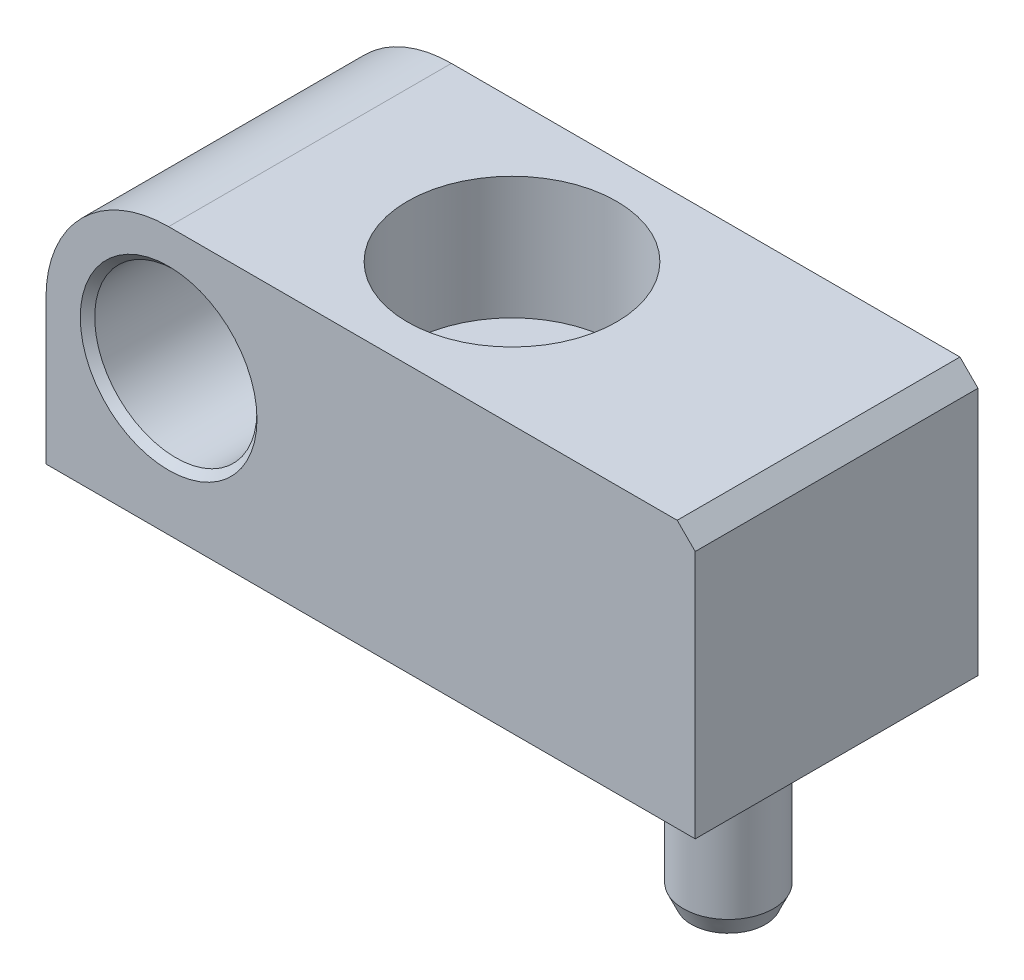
ISO-10303-21;
HEADER;
FILE_DESCRIPTION(('STEP AP214'),'2;1');
FILE_NAME('part.step','',(''),(''),'','','');
FILE_SCHEMA(('AUTOMOTIVE_DESIGN { 1 0 10303 214 1 1 1 1 }'));
ENDSEC;
DATA;
#1=APPLICATION_CONTEXT('core data for automotive mechanical design processes');
#2=APPLICATION_PROTOCOL_DEFINITION('international standard','automotive_design',2000,#1);
#3=PRODUCT_CONTEXT('',#1,'mechanical');
#4=PRODUCT('Part','Part','',(#3));
#5=PRODUCT_RELATED_PRODUCT_CATEGORY('part','',(#4));
#6=PRODUCT_DEFINITION_FORMATION('','',#4);
#7=PRODUCT_DEFINITION_CONTEXT('part definition',#1,'design');
#8=PRODUCT_DEFINITION('design','',#6,#7);
#9=PRODUCT_DEFINITION_SHAPE('','',#8);
#10=(LENGTH_UNIT() NAMED_UNIT(*) SI_UNIT(.MILLI.,.METRE.));
#11=(NAMED_UNIT(*) PLANE_ANGLE_UNIT() SI_UNIT($,.RADIAN.));
#12=(NAMED_UNIT(*) SI_UNIT($,.STERADIAN.) SOLID_ANGLE_UNIT());
#13=UNCERTAINTY_MEASURE_WITH_UNIT(LENGTH_MEASURE(1.E-05),#10,'distance_accuracy_value','');
#14=(GEOMETRIC_REPRESENTATION_CONTEXT(3) GLOBAL_UNCERTAINTY_ASSIGNED_CONTEXT((#13)) GLOBAL_UNIT_ASSIGNED_CONTEXT((#10,
#11,#12)) REPRESENTATION_CONTEXT('',''));
#15=CARTESIAN_POINT('',(0.,0.,0.));
#16=DIRECTION('',(0.,0.,1.));
#17=DIRECTION('',(1.,0.,0.));
#18=AXIS2_PLACEMENT_3D('',#15,#16,#17);
#19=CARTESIAN_POINT('',(0.,-5.,0.));
#20=DIRECTION('',(0.,-1.,0.));
#21=DIRECTION('',(0.,0.,-1.));
#22=AXIS2_PLACEMENT_3D('',#19,#20,#21);
#23=PLANE('',#22);
#24=CARTESIAN_POINT('',(0.,-4.99999999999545,0.));
#25=DIRECTION('',(0.,1.,0.));
#26=DIRECTION('',(0.,0.,1.));
#27=AXIS2_PLACEMENT_3D('',#24,#25,#26);
#28=CIRCLE('',#27,1.02856239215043);
#29=CARTESIAN_POINT('',(0.,-4.99999999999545,1.02856239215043));
#30=VERTEX_POINT('',#29);
#31=EDGE_CURVE('P0_E18',#30,#30,#28,.T.);
#32=ORIENTED_EDGE('',*,*,#31,.F.);
#33=EDGE_LOOP('',(#32));
#34=FACE_BOUND('',#33,.T.);
#35=ADVANCED_FACE('P0_F14',(#34),#23,.T.);
#36=CARTESIAN_POINT('',(-0.75,5.,0.));
#37=DIRECTION('',(0.,1.,0.));
#38=DIRECTION('',(0.,0.,1.));
#39=AXIS2_PLACEMENT_3D('',#36,#37,#38);
#40=PLANE('',#39);
#41=CARTESIAN_POINT('',(0.,5.,0.));
#42=DIRECTION('',(0.,1.,0.));
#43=DIRECTION('',(0.,0.,1.));
#44=AXIS2_PLACEMENT_3D('',#41,#42,#43);
#45=CIRCLE('',#44,0.75);
#46=CARTESIAN_POINT('',(0.,5.,0.75));
#47=VERTEX_POINT('',#46);
#48=EDGE_CURVE('P0_E27',#47,#47,#45,.F.);
#49=ORIENTED_EDGE('',*,*,#48,.F.);
#50=EDGE_LOOP('',(#49));
#51=FACE_BOUND('',#50,.T.);
#52=ADVANCED_FACE('P0_F38',(#51),#40,.T.);
#53=CARTESIAN_POINT('',(0.,-4.51229482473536,0.));
#54=DIRECTION('',(0.,1.,0.));
#55=DIRECTION('',(0.,0.,1.));
#56=AXIS2_PLACEMENT_3D('',#53,#54,#55);
#57=CONICAL_SURFACE('',#56,1.24999999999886,0.426208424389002);
#58=CARTESIAN_POINT('',(0.,-4.51229482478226,0.));
#59=DIRECTION('',(0.,1.,0.));
#60=DIRECTION('',(0.,0.,1.));
#61=AXIS2_PLACEMENT_3D('',#58,#59,#60);
#62=CIRCLE('',#61,1.25);
#63=CARTESIAN_POINT('',(0.,-4.51229482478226,1.25));
#64=VERTEX_POINT('',#63);
#65=EDGE_CURVE('P0_E22',#64,#64,#62,.T.);
#66=ORIENTED_EDGE('',*,*,#65,.F.);
#67=EDGE_LOOP('',(#66));
#68=FACE_BOUND('',#67,.T.);
#69=ORIENTED_EDGE('',*,*,#31,.T.);
#70=EDGE_LOOP('',(#69));
#71=FACE_BOUND('',#70,.T.);
#72=ADVANCED_FACE('P0_F35',(#68,#71),#57,.T.);
#73=CARTESIAN_POINT('',(0.,4.5,0.));
#74=DIRECTION('',(0.,1.,0.));
#75=DIRECTION('',(0.,0.,1.));
#76=AXIS2_PLACEMENT_3D('',#73,#74,#75);
#77=TOROIDAL_SURFACE('',#76,0.75,0.5);
#78=ORIENTED_EDGE('',*,*,#48,.T.);
#79=EDGE_LOOP('',(#78));
#80=FACE_BOUND('',#79,.T.);
#81=CARTESIAN_POINT('',(0.,4.5,0.));
#82=DIRECTION('',(0.,1.,0.));
#83=DIRECTION('',(0.,0.,1.));
#84=AXIS2_PLACEMENT_3D('',#81,#82,#83);
#85=CIRCLE('',#84,1.25);
#86=CARTESIAN_POINT('',(0.,4.5,1.25));
#87=VERTEX_POINT('',#86);
#88=EDGE_CURVE('P0_E9',#87,#87,#85,.F.);
#89=ORIENTED_EDGE('',*,*,#88,.F.);
#90=EDGE_LOOP('',(#89));
#91=FACE_BOUND('',#90,.T.);
#92=ADVANCED_FACE('P0_F16',(#80,#91),#77,.T.);
#93=CARTESIAN_POINT('',(0.,6.53388582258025,0.));
#94=DIRECTION('',(0.,1.,0.));
#95=DIRECTION('',(0.,0.,1.));
#96=AXIS2_PLACEMENT_3D('',#93,#94,#95);
#97=CYLINDRICAL_SURFACE('',#96,1.25);
#98=ORIENTED_EDGE('',*,*,#88,.T.);
#99=EDGE_LOOP('',(#98));
#100=FACE_BOUND('',#99,.T.);
#101=ORIENTED_EDGE('',*,*,#65,.T.);
#102=EDGE_LOOP('',(#101));
#103=FACE_BOUND('',#102,.T.);
#104=ADVANCED_FACE('P0_F45',(#100,#103),#97,.T.);
#105=CLOSED_SHELL('',(#35,#52,#72,#92,#104));
#106=MANIFOLD_SOLID_BREP('P0_B1',#105);
#107=CARTESIAN_POINT('',(-11.6,4.,-3.92));
#108=DIRECTION('',(0.,0.,1.));
#109=DIRECTION('',(1.,0.,0.));
#110=AXIS2_PLACEMENT_3D('',#107,#108,#109);
#111=CYLINDRICAL_SURFACE('',#110,2.25);
#112=CARTESIAN_POINT('',(-11.6,4.,-3.72000000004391));
#113=DIRECTION('',(0.,0.,-1.));
#114=DIRECTION('',(-1.,0.,0.));
#115=AXIS2_PLACEMENT_3D('',#112,#113,#114);
#116=CIRCLE('',#115,2.24999999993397);
#117=CARTESIAN_POINT('',(-13.849999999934,4.,-3.72000000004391));
#118=VERTEX_POINT('',#117);
#119=EDGE_CURVE('P1_E147',#118,#118,#116,.T.);
#120=ORIENTED_EDGE('',*,*,#119,.T.);
#121=EDGE_LOOP('',(#120));
#122=FACE_BOUND('',#121,.T.);
#123=CARTESIAN_POINT('',(-11.6,4.,3.72000000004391));
#124=DIRECTION('',(0.,0.,1.));
#125=DIRECTION('',(1.,0.,0.));
#126=AXIS2_PLACEMENT_3D('',#123,#124,#125);
#127=CIRCLE('',#126,2.24999999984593);
#128=CARTESIAN_POINT('',(-9.35000000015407,4.,3.72000000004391));
#129=VERTEX_POINT('',#128);
#130=EDGE_CURVE('P1_E150',#129,#129,#127,.T.);
#131=ORIENTED_EDGE('',*,*,#130,.T.);
#132=EDGE_LOOP('',(#131));
#133=FACE_BOUND('',#132,.T.);
#134=ADVANCED_FACE('P1_F17',(#122,#133),#111,.F.);
#135=CARTESIAN_POINT('',(-6.,4.,0.));
#136=DIRECTION('',(0.,1.,0.));
#137=DIRECTION('',(0.,0.,1.));
#138=AXIS2_PLACEMENT_3D('',#135,#136,#137);
#139=CYLINDRICAL_SURFACE('',#138,2.9);
#140=CARTESIAN_POINT('',(-6.,4.,0.));
#141=DIRECTION('',(0.,1.,0.));
#142=DIRECTION('',(0.,0.,1.));
#143=AXIS2_PLACEMENT_3D('',#140,#141,#142);
#144=CIRCLE('',#143,2.9);
#145=CARTESIAN_POINT('',(-6.,4.,2.9));
#146=VERTEX_POINT('',#145);
#147=EDGE_CURVE('P1_E20',#146,#146,#144,.T.);
#148=ORIENTED_EDGE('',*,*,#147,.F.);
#149=EDGE_LOOP('',(#148));
#150=FACE_BOUND('',#149,.T.);
#151=CARTESIAN_POINT('',(-6.,7.4,0.));
#152=DIRECTION('',(0.,1.,0.));
#153=DIRECTION('',(0.,0.,1.));
#154=AXIS2_PLACEMENT_3D('',#151,#152,#153);
#155=CIRCLE('',#154,2.9);
#156=CARTESIAN_POINT('',(-6.,7.4,2.9));
#157=VERTEX_POINT('',#156);
#158=EDGE_CURVE('P1_E79',#157,#157,#155,.F.);
#159=ORIENTED_EDGE('',*,*,#158,.F.);
#160=EDGE_LOOP('',(#159));
#161=FACE_BOUND('',#160,.T.);
#162=ADVANCED_FACE('P1_F170',(#150,#161),#139,.F.);
#163=CARTESIAN_POINT('',(0.,5.,0.));
#164=DIRECTION('',(0.,-1.,0.));
#165=DIRECTION('',(1.,0.,0.));
#166=AXIS2_PLACEMENT_3D('',#163,#164,#165);
#167=PLANE('',#166);
#168=CARTESIAN_POINT('',(0.,5.,0.));
#169=DIRECTION('',(0.,-1.,0.));
#170=DIRECTION('',(1.,0.,0.));
#171=AXIS2_PLACEMENT_3D('',#168,#169,#170);
#172=CIRCLE('',#171,1.25);
#173=CARTESIAN_POINT('',(1.25,5.,0.));
#174=VERTEX_POINT('',#173);
#175=EDGE_CURVE('P1_E125',#174,#174,#172,.T.);
#176=ORIENTED_EDGE('',*,*,#175,.T.);
#177=EDGE_LOOP('',(#176));
#178=FACE_BOUND('',#177,.T.);
#179=ADVANCED_FACE('P1_F172',(#178),#167,.T.);
#180=CARTESIAN_POINT('',(-6.,4.,0.));
#181=DIRECTION('',(0.,1.,0.));
#182=DIRECTION('',(0.,0.,1.));
#183=AXIS2_PLACEMENT_3D('',#180,#181,#182);
#184=PLANE('',#183);
#185=ORIENTED_EDGE('',*,*,#147,.T.);
#186=EDGE_LOOP('',(#185));
#187=FACE_BOUND('',#186,.T.);
#188=CARTESIAN_POINT('',(-6.,4.,0.));
#189=DIRECTION('',(0.,1.,0.));
#190=DIRECTION('',(0.,0.,1.));
#191=AXIS2_PLACEMENT_3D('',#188,#189,#190);
#192=CIRCLE('',#191,1.65);
#193=CARTESIAN_POINT('',(-6.,4.,1.65));
#194=VERTEX_POINT('',#193);
#195=EDGE_CURVE('P1_E163',#194,#194,#192,.F.);
#196=ORIENTED_EDGE('',*,*,#195,.T.);
#197=EDGE_LOOP('',(#196));
#198=FACE_BOUND('',#197,.T.);
#199=ADVANCED_FACE('P1_F179',(#187,#198),#184,.T.);
#200=CARTESIAN_POINT('',(-11.6,4.,3.92000000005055));
#201=DIRECTION('',(0.,0.,1.));
#202=DIRECTION('',(1.,0.,0.));
#203=AXIS2_PLACEMENT_3D('',#200,#201,#202);
#204=CONICAL_SURFACE('',#203,2.44999999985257,0.785398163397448);
#205=ORIENTED_EDGE('',*,*,#130,.F.);
#206=EDGE_LOOP('',(#205));
#207=FACE_BOUND('',#206,.T.);
#208=CARTESIAN_POINT('',(-11.6,4.,3.92000000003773));
#209=DIRECTION('',(0.,0.,1.));
#210=DIRECTION('',(1.,0.,0.));
#211=AXIS2_PLACEMENT_3D('',#208,#209,#210);
#212=CIRCLE('',#211,2.44999999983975);
#213=CARTESIAN_POINT('',(-9.15000000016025,4.,3.92000000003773));
#214=VERTEX_POINT('',#213);
#215=EDGE_CURVE('P1_E90',#214,#214,#212,.F.);
#216=ORIENTED_EDGE('',*,*,#215,.F.);
#217=EDGE_LOOP('',(#216));
#218=FACE_BOUND('',#217,.T.);
#219=ADVANCED_FACE('P1_F224',(#207,#218),#204,.F.);
#220=CARTESIAN_POINT('',(-11.6,4.,-3.91999999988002));
#221=DIRECTION('',(0.,0.,-1.));
#222=DIRECTION('',(-1.,0.,0.));
#223=AXIS2_PLACEMENT_3D('',#220,#221,#222);
#224=CONICAL_SURFACE('',#223,2.44999999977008,0.785398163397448);
#225=ORIENTED_EDGE('',*,*,#119,.F.);
#226=EDGE_LOOP('',(#225));
#227=FACE_BOUND('',#226,.T.);
#228=CARTESIAN_POINT('',(-11.6,4.,-3.92000000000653));
#229=DIRECTION('',(0.,0.,-1.));
#230=DIRECTION('',(-1.,0.,0.));
#231=AXIS2_PLACEMENT_3D('',#228,#229,#230);
#232=CIRCLE('',#231,2.44999999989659);
#233=CARTESIAN_POINT('',(-14.0499999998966,4.,-3.92000000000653));
#234=VERTEX_POINT('',#233);
#235=EDGE_CURVE('P1_E106',#234,#234,#232,.T.);
#236=ORIENTED_EDGE('',*,*,#235,.T.);
#237=EDGE_LOOP('',(#236));
#238=FACE_BOUND('',#237,.T.);
#239=ADVANCED_FACE('P1_F221',(#227,#238),#224,.F.);
#240=CARTESIAN_POINT('',(-11.6,7.4,-3.92));
#241=DIRECTION('',(0.,1.,0.));
#242=DIRECTION('',(-1.,0.,0.));
#243=AXIS2_PLACEMENT_3D('',#240,#241,#242);
#244=PLANE('',#243);
#245=DIRECTION('',(1.,0.,0.));
#246=VECTOR('',#245,1.);
#247=CARTESIAN_POINT('',(-11.6,7.4,-3.92));
#248=LINE('',#247,#246);
#249=CARTESIAN_POINT('',(2.5,7.4,-3.92));
#250=VERTEX_POINT('',#249);
#251=CARTESIAN_POINT('',(-11.6,7.4,-3.92));
#252=VERTEX_POINT('',#251);
#253=EDGE_CURVE('P1_E75',#250,#252,#248,.F.);
#254=ORIENTED_EDGE('',*,*,#253,.T.);
#255=DIRECTION('',(0.,0.,1.));
#256=VECTOR('',#255,1.);
#257=CARTESIAN_POINT('',(-11.6,7.4,-3.92));
#258=LINE('',#257,#256);
#259=CARTESIAN_POINT('',(-11.6,7.4,3.92));
#260=VERTEX_POINT('',#259);
#261=EDGE_CURVE('P1_E67',#260,#252,#258,.F.);
#262=ORIENTED_EDGE('',*,*,#261,.F.);
#263=DIRECTION('',(1.,0.,0.));
#264=VECTOR('',#263,1.);
#265=CARTESIAN_POINT('',(-11.6,7.4,3.92));
#266=LINE('',#265,#264);
#267=CARTESIAN_POINT('',(2.5,7.4,3.92));
#268=VERTEX_POINT('',#267);
#269=EDGE_CURVE('P1_E72',#268,#260,#266,.F.);
#270=ORIENTED_EDGE('',*,*,#269,.F.);
#271=DIRECTION('',(0.,0.,1.));
#272=VECTOR('',#271,1.);
#273=CARTESIAN_POINT('',(2.5,7.4,-3.92));
#274=LINE('',#273,#272);
#275=EDGE_CURVE('P1_E78',#250,#268,#274,.T.);
#276=ORIENTED_EDGE('',*,*,#275,.F.);
#277=EDGE_LOOP('',(#254,#262,#270,#276));
#278=FACE_BOUND('',#277,.T.);
#279=ORIENTED_EDGE('',*,*,#158,.T.);
#280=EDGE_LOOP('',(#279));
#281=FACE_BOUND('',#280,.T.);
#282=ADVANCED_FACE('P1_F69',(#278,#281),#244,.T.);
#283=CARTESIAN_POINT('',(-11.6,4.,-3.92));
#284=DIRECTION('',(0.,0.,1.));
#285=DIRECTION('',(1.,0.,0.));
#286=AXIS2_PLACEMENT_3D('',#283,#284,#285);
#287=CYLINDRICAL_SURFACE('',#286,3.4);
#288=CARTESIAN_POINT('',(-11.6,4.,-3.92));
#289=DIRECTION('',(0.,0.,1.));
#290=DIRECTION('',(1.,0.,0.));
#291=AXIS2_PLACEMENT_3D('',#288,#289,#290);
#292=CIRCLE('',#291,3.4);
#293=CARTESIAN_POINT('',(-15.,4.,-3.92));
#294=VERTEX_POINT('',#293);
#295=EDGE_CURVE('P1_E157',#252,#294,#292,.T.);
#296=ORIENTED_EDGE('',*,*,#295,.T.);
#297=DIRECTION('',(0.,0.,1.));
#298=VECTOR('',#297,1.);
#299=CARTESIAN_POINT('',(-15.,4.,-3.92));
#300=LINE('',#299,#298);
#301=CARTESIAN_POINT('',(-15.,4.,3.92));
#302=VERTEX_POINT('',#301);
#303=EDGE_CURVE('P1_E86',#302,#294,#300,.F.);
#304=ORIENTED_EDGE('',*,*,#303,.F.);
#305=CARTESIAN_POINT('',(-11.6,4.,3.92));
#306=DIRECTION('',(0.,0.,1.));
#307=DIRECTION('',(1.,0.,0.));
#308=AXIS2_PLACEMENT_3D('',#305,#306,#307);
#309=CIRCLE('',#308,3.4);
#310=EDGE_CURVE('P1_E83',#260,#302,#309,.T.);
#311=ORIENTED_EDGE('',*,*,#310,.F.);
#312=ORIENTED_EDGE('',*,*,#261,.T.);
#313=EDGE_LOOP('',(#296,#304,#311,#312));
#314=FACE_BOUND('',#313,.T.);
#315=ADVANCED_FACE('P1_F84',(#314),#287,.T.);
#316=CARTESIAN_POINT('',(2.5,7.4,-3.92));
#317=DIRECTION('',(0.707106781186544,0.707106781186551,0.));
#318=DIRECTION('',(-0.707106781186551,0.707106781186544,0.));
#319=AXIS2_PLACEMENT_3D('',#316,#317,#318);
#320=PLANE('',#319);
#321=DIRECTION('',(-0.707106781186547,0.707106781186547,0.));
#322=VECTOR('',#321,1.);
#323=CARTESIAN_POINT('',(3.,6.9,-3.92));
#324=LINE('',#323,#322);
#325=CARTESIAN_POINT('',(3.,6.9,-3.92));
#326=VERTEX_POINT('',#325);
#327=EDGE_CURVE('P1_E117',#326,#250,#324,.T.);
#328=ORIENTED_EDGE('',*,*,#327,.T.);
#329=ORIENTED_EDGE('',*,*,#275,.T.);
#330=DIRECTION('',(-0.70710678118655,0.707106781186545,0.));
#331=VECTOR('',#330,1.);
#332=CARTESIAN_POINT('',(3.,6.9,3.92));
#333=LINE('',#332,#331);
#334=CARTESIAN_POINT('',(3.,6.9,3.92));
#335=VERTEX_POINT('',#334);
#336=EDGE_CURVE('P1_E89',#335,#268,#333,.T.);
#337=ORIENTED_EDGE('',*,*,#336,.F.);
#338=DIRECTION('',(0.,0.,-1.));
#339=VECTOR('',#338,1.);
#340=CARTESIAN_POINT('',(3.,6.9,-3.92));
#341=LINE('',#340,#339);
#342=EDGE_CURVE('P1_E141',#326,#335,#341,.F.);
#343=ORIENTED_EDGE('',*,*,#342,.F.);
#344=EDGE_LOOP('',(#328,#329,#337,#343));
#345=FACE_BOUND('',#344,.T.);
#346=ADVANCED_FACE('P1_F212',(#345),#320,.T.);
#347=CARTESIAN_POINT('',(0.,5.,0.));
#348=DIRECTION('',(0.,-1.,0.));
#349=DIRECTION('',(1.,0.,0.));
#350=AXIS2_PLACEMENT_3D('',#347,#348,#349);
#351=CYLINDRICAL_SURFACE('',#350,1.25);
#352=ORIENTED_EDGE('',*,*,#175,.F.);
#353=EDGE_LOOP('',(#352));
#354=FACE_BOUND('',#353,.T.);
#355=CARTESIAN_POINT('',(0.,0.,0.));
#356=DIRECTION('',(0.,-1.,0.));
#357=DIRECTION('',(1.,0.,0.));
#358=AXIS2_PLACEMENT_3D('',#355,#356,#357);
#359=CIRCLE('',#358,1.25);
#360=CARTESIAN_POINT('',(1.25,0.,0.));
#361=VERTEX_POINT('',#360);
#362=EDGE_CURVE('P1_E144',#361,#361,#359,.F.);
#363=ORIENTED_EDGE('',*,*,#362,.F.);
#364=EDGE_LOOP('',(#363));
#365=FACE_BOUND('',#364,.T.);
#366=ADVANCED_FACE('P1_F208',(#354,#365),#351,.F.);
#367=CARTESIAN_POINT('',(-6.,0.,0.));
#368=DIRECTION('',(0.,1.,0.));
#369=DIRECTION('',(0.,0.,1.));
#370=AXIS2_PLACEMENT_3D('',#367,#368,#369);
#371=CYLINDRICAL_SURFACE('',#370,1.65);
#372=ORIENTED_EDGE('',*,*,#195,.F.);
#373=EDGE_LOOP('',(#372));
#374=FACE_BOUND('',#373,.T.);
#375=CARTESIAN_POINT('',(-6.,0.,0.));
#376=DIRECTION('',(0.,1.,0.));
#377=DIRECTION('',(0.,0.,1.));
#378=AXIS2_PLACEMENT_3D('',#375,#376,#377);
#379=CIRCLE('',#378,1.65);
#380=CARTESIAN_POINT('',(-6.,0.,1.65));
#381=VERTEX_POINT('',#380);
#382=EDGE_CURVE('P1_E132',#381,#381,#379,.T.);
#383=ORIENTED_EDGE('',*,*,#382,.F.);
#384=EDGE_LOOP('',(#383));
#385=FACE_BOUND('',#384,.T.);
#386=ADVANCED_FACE('P1_F205',(#374,#385),#371,.F.);
#387=CARTESIAN_POINT('',(-11.6,4.,3.92));
#388=DIRECTION('',(0.,0.,1.));
#389=DIRECTION('',(1.,0.,0.));
#390=AXIS2_PLACEMENT_3D('',#387,#388,#389);
#391=PLANE('',#390);
#392=ORIENTED_EDGE('',*,*,#336,.T.);
#393=ORIENTED_EDGE('',*,*,#269,.T.);
#394=ORIENTED_EDGE('',*,*,#310,.T.);
#395=DIRECTION('',(0.,-1.,0.));
#396=VECTOR('',#395,1.);
#397=CARTESIAN_POINT('',(-15.,0.,3.92));
#398=LINE('',#397,#396);
#399=CARTESIAN_POINT('',(-15.,0.,3.92));
#400=VERTEX_POINT('',#399);
#401=EDGE_CURVE('P1_E95',#400,#302,#398,.F.);
#402=ORIENTED_EDGE('',*,*,#401,.F.);
#403=DIRECTION('',(1.,0.,0.));
#404=VECTOR('',#403,1.);
#405=CARTESIAN_POINT('',(3.,0.,3.92));
#406=LINE('',#405,#404);
#407=CARTESIAN_POINT('',(3.,0.,3.92));
#408=VERTEX_POINT('',#407);
#409=EDGE_CURVE('P1_E114',#408,#400,#406,.F.);
#410=ORIENTED_EDGE('',*,*,#409,.F.);
#411=DIRECTION('',(0.,1.,0.));
#412=VECTOR('',#411,1.);
#413=CARTESIAN_POINT('',(3.,0.,3.92));
#414=LINE('',#413,#412);
#415=EDGE_CURVE('P1_E120',#335,#408,#414,.F.);
#416=ORIENTED_EDGE('',*,*,#415,.F.);
#417=EDGE_LOOP('',(#392,#393,#394,#402,#410,#416));
#418=FACE_BOUND('',#417,.T.);
#419=ORIENTED_EDGE('',*,*,#215,.T.);
#420=EDGE_LOOP('',(#419));
#421=FACE_BOUND('',#420,.T.);
#422=ADVANCED_FACE('P1_F92',(#418,#421),#391,.T.);
#423=CARTESIAN_POINT('',(-15.,0.,-3.92));
#424=DIRECTION('',(-1.,0.,0.));
#425=DIRECTION('',(0.,-1.,0.));
#426=AXIS2_PLACEMENT_3D('',#423,#424,#425);
#427=PLANE('',#426);
#428=DIRECTION('',(0.,1.,0.));
#429=VECTOR('',#428,1.);
#430=CARTESIAN_POINT('',(-15.,4.,-3.92));
#431=LINE('',#430,#429);
#432=CARTESIAN_POINT('',(-15.,0.,-3.92));
#433=VERTEX_POINT('',#432);
#434=EDGE_CURVE('P1_E121',#294,#433,#431,.F.);
#435=ORIENTED_EDGE('',*,*,#434,.T.);
#436=DIRECTION('',(0.,0.,1.));
#437=VECTOR('',#436,1.);
#438=CARTESIAN_POINT('',(-15.,0.,-3.92));
#439=LINE('',#438,#437);
#440=EDGE_CURVE('P1_E109',#400,#433,#439,.F.);
#441=ORIENTED_EDGE('',*,*,#440,.F.);
#442=ORIENTED_EDGE('',*,*,#401,.T.);
#443=ORIENTED_EDGE('',*,*,#303,.T.);
#444=EDGE_LOOP('',(#435,#441,#442,#443));
#445=FACE_BOUND('',#444,.T.);
#446=ADVANCED_FACE('P1_F199',(#445),#427,.T.);
#447=CARTESIAN_POINT('',(-11.6,4.,-3.92));
#448=DIRECTION('',(0.,0.,1.));
#449=DIRECTION('',(1.,0.,0.));
#450=AXIS2_PLACEMENT_3D('',#447,#448,#449);
#451=PLANE('',#450);
#452=DIRECTION('',(0.,1.,0.));
#453=VECTOR('',#452,1.);
#454=CARTESIAN_POINT('',(3.,0.,-3.92));
#455=LINE('',#454,#453);
#456=CARTESIAN_POINT('',(3.,0.,-3.92));
#457=VERTEX_POINT('',#456);
#458=EDGE_CURVE('P1_E35',#457,#326,#455,.T.);
#459=ORIENTED_EDGE('',*,*,#458,.F.);
#460=DIRECTION('',(1.,0.,0.));
#461=VECTOR('',#460,1.);
#462=CARTESIAN_POINT('',(3.,0.,-3.92));
#463=LINE('',#462,#461);
#464=EDGE_CURVE('P1_E26',#433,#457,#463,.T.);
#465=ORIENTED_EDGE('',*,*,#464,.F.);
#466=ORIENTED_EDGE('',*,*,#434,.F.);
#467=ORIENTED_EDGE('',*,*,#295,.F.);
#468=ORIENTED_EDGE('',*,*,#253,.F.);
#469=ORIENTED_EDGE('',*,*,#327,.F.);
#470=EDGE_LOOP('',(#459,#465,#466,#467,#468,#469));
#471=FACE_BOUND('',#470,.T.);
#472=ORIENTED_EDGE('',*,*,#235,.F.);
#473=EDGE_LOOP('',(#472));
#474=FACE_BOUND('',#473,.T.);
#475=ADVANCED_FACE('P1_F192',(#471,#474),#451,.F.);
#476=CARTESIAN_POINT('',(3.,0.,-3.92));
#477=DIRECTION('',(1.,0.,0.));
#478=DIRECTION('',(0.,0.,-1.));
#479=AXIS2_PLACEMENT_3D('',#476,#477,#478);
#480=PLANE('',#479);
#481=ORIENTED_EDGE('',*,*,#458,.T.);
#482=ORIENTED_EDGE('',*,*,#342,.T.);
#483=ORIENTED_EDGE('',*,*,#415,.T.);
#484=DIRECTION('',(0.,0.,1.));
#485=VECTOR('',#484,1.);
#486=CARTESIAN_POINT('',(3.,0.,-3.92));
#487=LINE('',#486,#485);
#488=EDGE_CURVE('P1_E11',#457,#408,#487,.T.);
#489=ORIENTED_EDGE('',*,*,#488,.F.);
#490=EDGE_LOOP('',(#481,#482,#483,#489));
#491=FACE_BOUND('',#490,.T.);
#492=ADVANCED_FACE('P1_F186',(#491),#480,.T.);
#493=CARTESIAN_POINT('',(3.,0.,-3.92));
#494=DIRECTION('',(0.,-1.,0.));
#495=DIRECTION('',(1.,0.,0.));
#496=AXIS2_PLACEMENT_3D('',#493,#494,#495);
#497=PLANE('',#496);
#498=ORIENTED_EDGE('',*,*,#464,.T.);
#499=ORIENTED_EDGE('',*,*,#488,.T.);
#500=ORIENTED_EDGE('',*,*,#409,.T.);
#501=ORIENTED_EDGE('',*,*,#440,.T.);
#502=EDGE_LOOP('',(#498,#499,#500,#501));
#503=FACE_BOUND('',#502,.T.);
#504=ORIENTED_EDGE('',*,*,#382,.T.);
#505=EDGE_LOOP('',(#504));
#506=FACE_BOUND('',#505,.T.);
#507=ORIENTED_EDGE('',*,*,#362,.T.);
#508=EDGE_LOOP('',(#507));
#509=FACE_BOUND('',#508,.T.);
#510=ADVANCED_FACE('P1_F184',(#503,#506,#509),#497,.T.);
#511=CLOSED_SHELL('',(#134,#162,#179,#199,#219,#239,#282,#315,#346,#366,#386,#422,#446,#475,
#492,#510));
#512=MANIFOLD_SOLID_BREP('P1_B1',#511);
#513=ADVANCED_BREP_SHAPE_REPRESENTATION('',(#18,#106,#512),#14);
#514=SHAPE_DEFINITION_REPRESENTATION(#9,#513);
ENDSEC;
END-ISO-10303-21;
